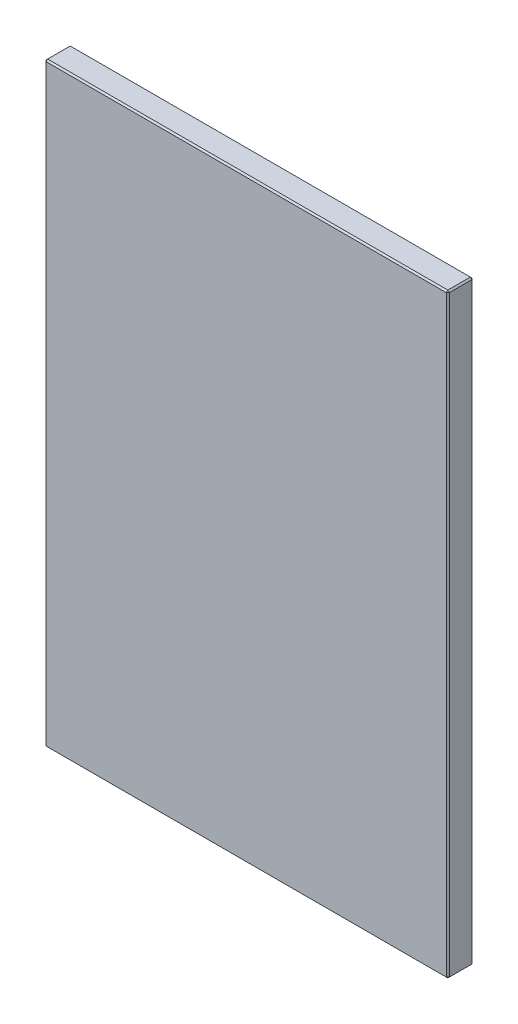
ISO-10303-21;
HEADER;
FILE_DESCRIPTION(('STEP AP214'),'2;1');
FILE_NAME('part.step','',(''),(''),'','','');
FILE_SCHEMA(('AUTOMOTIVE_DESIGN { 1 0 10303 214 1 1 1 1 }'));
ENDSEC;
DATA;
#1=APPLICATION_CONTEXT('core data for automotive mechanical design processes');
#2=APPLICATION_PROTOCOL_DEFINITION('international standard','automotive_design',2000,#1);
#3=PRODUCT_CONTEXT('',#1,'mechanical');
#4=PRODUCT('Part','Part','',(#3));
#5=PRODUCT_RELATED_PRODUCT_CATEGORY('part','',(#4));
#6=PRODUCT_DEFINITION_FORMATION('','',#4);
#7=PRODUCT_DEFINITION_CONTEXT('part definition',#1,'design');
#8=PRODUCT_DEFINITION('design','',#6,#7);
#9=PRODUCT_DEFINITION_SHAPE('','',#8);
#10=(LENGTH_UNIT() NAMED_UNIT(*) SI_UNIT(.MILLI.,.METRE.));
#11=(NAMED_UNIT(*) PLANE_ANGLE_UNIT() SI_UNIT($,.RADIAN.));
#12=(NAMED_UNIT(*) SI_UNIT($,.STERADIAN.) SOLID_ANGLE_UNIT());
#13=UNCERTAINTY_MEASURE_WITH_UNIT(LENGTH_MEASURE(1.E-05),#10,'distance_accuracy_value','');
#14=(GEOMETRIC_REPRESENTATION_CONTEXT(3) GLOBAL_UNCERTAINTY_ASSIGNED_CONTEXT((#13)) GLOBAL_UNIT_ASSIGNED_CONTEXT((#10,
#11,#12)) REPRESENTATION_CONTEXT('',''));
#15=CARTESIAN_POINT('',(0.,0.,0.));
#16=DIRECTION('',(0.,0.,1.));
#17=DIRECTION('',(1.,0.,0.));
#18=AXIS2_PLACEMENT_3D('',#15,#16,#17);
#19=CARTESIAN_POINT('',(-134.,-198.,17.));
#20=DIRECTION('',(1.,0.,0.));
#21=DIRECTION('',(0.,0.,-1.));
#22=AXIS2_PLACEMENT_3D('',#19,#20,#21);
#23=PLANE('',#22);
#24=DIRECTION('',(0.,0.,-1.));
#25=VECTOR('',#24,1.);
#26=CARTESIAN_POINT('',(-134.,197.,17.));
#27=LINE('',#26,#25);
#28=CARTESIAN_POINT('',(-134.,197.,16.));
#29=VERTEX_POINT('',#28);
#30=CARTESIAN_POINT('',(-134.,197.,1.));
#31=VERTEX_POINT('',#30);
#32=EDGE_CURVE('E114',#29,#31,#27,.T.);
#33=ORIENTED_EDGE('',*,*,#32,.T.);
#34=DIRECTION('',(0.,-1.,0.));
#35=VECTOR('',#34,1.);
#36=CARTESIAN_POINT('',(-134.,-198.,1.));
#37=LINE('',#36,#35);
#38=CARTESIAN_POINT('',(-134.,-197.,1.));
#39=VERTEX_POINT('',#38);
#40=EDGE_CURVE('E110',#31,#39,#37,.T.);
#41=ORIENTED_EDGE('',*,*,#40,.T.);
#42=DIRECTION('',(0.,0.,1.));
#43=VECTOR('',#42,1.);
#44=CARTESIAN_POINT('',(-134.,-197.,17.));
#45=LINE('',#44,#43);
#46=CARTESIAN_POINT('',(-134.,-197.,16.));
#47=VERTEX_POINT('',#46);
#48=EDGE_CURVE('E103',#39,#47,#45,.T.);
#49=ORIENTED_EDGE('',*,*,#48,.T.);
#50=DIRECTION('',(0.,1.,0.));
#51=VECTOR('',#50,1.);
#52=CARTESIAN_POINT('',(-134.,198.,16.));
#53=LINE('',#52,#51);
#54=EDGE_CURVE('E107',#47,#29,#53,.T.);
#55=ORIENTED_EDGE('',*,*,#54,.T.);
#56=EDGE_LOOP('',(#33,#41,#49,#55));
#57=FACE_BOUND('',#56,.T.);
#58=ADVANCED_FACE('F15',(#57),#23,.F.);
#59=CARTESIAN_POINT('',(134.,-198.,17.));
#60=DIRECTION('',(0.,1.,0.));
#61=DIRECTION('',(0.,0.,1.));
#62=AXIS2_PLACEMENT_3D('',#59,#60,#61);
#63=PLANE('',#62);
#64=DIRECTION('',(0.,0.,-1.));
#65=VECTOR('',#64,1.);
#66=CARTESIAN_POINT('',(-133.,-198.,17.));
#67=LINE('',#66,#65);
#68=CARTESIAN_POINT('',(-133.,-198.,16.));
#69=VERTEX_POINT('',#68);
#70=CARTESIAN_POINT('',(-133.,-198.,1.));
#71=VERTEX_POINT('',#70);
#72=EDGE_CURVE('E122',#69,#71,#67,.T.);
#73=ORIENTED_EDGE('',*,*,#72,.T.);
#74=DIRECTION('',(1.,0.,0.));
#75=VECTOR('',#74,1.);
#76=CARTESIAN_POINT('',(134.,-198.,1.));
#77=LINE('',#76,#75);
#78=CARTESIAN_POINT('',(133.,-198.,1.));
#79=VERTEX_POINT('',#78);
#80=EDGE_CURVE('E160',#71,#79,#77,.T.);
#81=ORIENTED_EDGE('',*,*,#80,.T.);
#82=DIRECTION('',(0.,0.,1.));
#83=VECTOR('',#82,1.);
#84=CARTESIAN_POINT('',(133.,-198.,17.));
#85=LINE('',#84,#83);
#86=CARTESIAN_POINT('',(133.,-198.,16.));
#87=VERTEX_POINT('',#86);
#88=EDGE_CURVE('E157',#79,#87,#85,.T.);
#89=ORIENTED_EDGE('',*,*,#88,.T.);
#90=DIRECTION('',(-1.,0.,0.));
#91=VECTOR('',#90,1.);
#92=CARTESIAN_POINT('',(-134.,-198.,16.));
#93=LINE('',#92,#91);
#94=EDGE_CURVE('E155',#87,#69,#93,.T.);
#95=ORIENTED_EDGE('',*,*,#94,.T.);
#96=EDGE_LOOP('',(#73,#81,#89,#95));
#97=FACE_BOUND('',#96,.T.);
#98=ADVANCED_FACE('F277',(#97),#63,.F.);
#99=CARTESIAN_POINT('',(134.,-198.,17.));
#100=DIRECTION('',(-1.,0.,0.));
#101=DIRECTION('',(0.,0.,1.));
#102=AXIS2_PLACEMENT_3D('',#99,#100,#101);
#103=PLANE('',#102);
#104=DIRECTION('',(0.,-1.,0.));
#105=VECTOR('',#104,1.);
#106=CARTESIAN_POINT('',(134.,-198.,16.));
#107=LINE('',#106,#105);
#108=CARTESIAN_POINT('',(134.,197.,16.));
#109=VERTEX_POINT('',#108);
#110=CARTESIAN_POINT('',(134.,-197.,16.));
#111=VERTEX_POINT('',#110);
#112=EDGE_CURVE('E162',#109,#111,#107,.T.);
#113=ORIENTED_EDGE('',*,*,#112,.T.);
#114=DIRECTION('',(0.,0.,-1.));
#115=VECTOR('',#114,1.);
#116=CARTESIAN_POINT('',(134.,-197.,17.));
#117=LINE('',#116,#115);
#118=CARTESIAN_POINT('',(134.,-197.,1.));
#119=VERTEX_POINT('',#118);
#120=EDGE_CURVE('E168',#111,#119,#117,.T.);
#121=ORIENTED_EDGE('',*,*,#120,.T.);
#122=DIRECTION('',(0.,1.,0.));
#123=VECTOR('',#122,1.);
#124=CARTESIAN_POINT('',(134.,-198.,1.));
#125=LINE('',#124,#123);
#126=CARTESIAN_POINT('',(134.,197.,1.));
#127=VERTEX_POINT('',#126);
#128=EDGE_CURVE('E166',#119,#127,#125,.T.);
#129=ORIENTED_EDGE('',*,*,#128,.T.);
#130=DIRECTION('',(0.,0.,1.));
#131=VECTOR('',#130,1.);
#132=CARTESIAN_POINT('',(134.,197.,17.));
#133=LINE('',#132,#131);
#134=EDGE_CURVE('E164',#127,#109,#133,.T.);
#135=ORIENTED_EDGE('',*,*,#134,.T.);
#136=EDGE_LOOP('',(#113,#121,#129,#135));
#137=FACE_BOUND('',#136,.T.);
#138=ADVANCED_FACE('F254',(#137),#103,.F.);
#139=CARTESIAN_POINT('',(134.,198.,17.));
#140=DIRECTION('',(0.,-1.,0.));
#141=DIRECTION('',(1.,0.,0.));
#142=AXIS2_PLACEMENT_3D('',#139,#140,#141);
#143=PLANE('',#142);
#144=DIRECTION('',(-1.,0.,0.));
#145=VECTOR('',#144,1.);
#146=CARTESIAN_POINT('',(134.,198.,1.));
#147=LINE('',#146,#145);
#148=CARTESIAN_POINT('',(133.,198.,1.));
#149=VERTEX_POINT('',#148);
#150=CARTESIAN_POINT('',(-133.,198.,1.));
#151=VERTEX_POINT('',#150);
#152=EDGE_CURVE('E150',#149,#151,#147,.T.);
#153=ORIENTED_EDGE('',*,*,#152,.T.);
#154=DIRECTION('',(0.,0.,1.));
#155=VECTOR('',#154,1.);
#156=CARTESIAN_POINT('',(-133.,198.,17.));
#157=LINE('',#156,#155);
#158=CARTESIAN_POINT('',(-133.,198.,16.));
#159=VERTEX_POINT('',#158);
#160=EDGE_CURVE('E152',#151,#159,#157,.T.);
#161=ORIENTED_EDGE('',*,*,#160,.T.);
#162=DIRECTION('',(1.,0.,0.));
#163=VECTOR('',#162,1.);
#164=CARTESIAN_POINT('',(134.,198.,16.));
#165=LINE('',#164,#163);
#166=CARTESIAN_POINT('',(133.,198.,16.));
#167=VERTEX_POINT('',#166);
#168=EDGE_CURVE('E146',#159,#167,#165,.T.);
#169=ORIENTED_EDGE('',*,*,#168,.T.);
#170=DIRECTION('',(0.,0.,-1.));
#171=VECTOR('',#170,1.);
#172=CARTESIAN_POINT('',(133.,198.,17.));
#173=LINE('',#172,#171);
#174=EDGE_CURVE('E148',#167,#149,#173,.T.);
#175=ORIENTED_EDGE('',*,*,#174,.T.);
#176=EDGE_LOOP('',(#153,#161,#169,#175));
#177=FACE_BOUND('',#176,.T.);
#178=ADVANCED_FACE('F286',(#177),#143,.F.);
#179=CARTESIAN_POINT('',(0.,0.,17.));
#180=DIRECTION('',(0.,0.,1.));
#181=DIRECTION('',(1.,0.,0.));
#182=AXIS2_PLACEMENT_3D('',#179,#180,#181);
#183=PLANE('',#182);
#184=DIRECTION('',(0.,1.,0.));
#185=VECTOR('',#184,1.);
#186=CARTESIAN_POINT('',(133.,198.,17.));
#187=LINE('',#186,#185);
#188=CARTESIAN_POINT('',(133.,-197.,17.));
#189=VERTEX_POINT('',#188);
#190=CARTESIAN_POINT('',(133.,197.,17.));
#191=VERTEX_POINT('',#190);
#192=EDGE_CURVE('E24',#189,#191,#187,.T.);
#193=ORIENTED_EDGE('',*,*,#192,.T.);
#194=DIRECTION('',(-1.,0.,0.));
#195=VECTOR('',#194,1.);
#196=CARTESIAN_POINT('',(-134.,197.,17.));
#197=LINE('',#196,#195);
#198=CARTESIAN_POINT('',(-133.,197.,17.));
#199=VERTEX_POINT('',#198);
#200=EDGE_CURVE('E9',#191,#199,#197,.T.);
#201=ORIENTED_EDGE('',*,*,#200,.T.);
#202=DIRECTION('',(0.,-1.,0.));
#203=VECTOR('',#202,1.);
#204=CARTESIAN_POINT('',(-133.,-198.,17.));
#205=LINE('',#204,#203);
#206=CARTESIAN_POINT('',(-133.,-197.,17.));
#207=VERTEX_POINT('',#206);
#208=EDGE_CURVE('E180',#199,#207,#205,.T.);
#209=ORIENTED_EDGE('',*,*,#208,.T.);
#210=DIRECTION('',(1.,0.,0.));
#211=VECTOR('',#210,1.);
#212=CARTESIAN_POINT('',(134.,-197.,17.));
#213=LINE('',#212,#211);
#214=EDGE_CURVE('E35',#207,#189,#213,.T.);
#215=ORIENTED_EDGE('',*,*,#214,.T.);
#216=EDGE_LOOP('',(#193,#201,#209,#215));
#217=FACE_BOUND('',#216,.T.);
#218=ADVANCED_FACE('F351',(#217),#183,.T.);
#219=CARTESIAN_POINT('',(0.,0.,0.));
#220=DIRECTION('',(0.,0.,1.));
#221=DIRECTION('',(1.,0.,0.));
#222=AXIS2_PLACEMENT_3D('',#219,#220,#221);
#223=PLANE('',#222);
#224=DIRECTION('',(0.,-1.,0.));
#225=VECTOR('',#224,1.);
#226=CARTESIAN_POINT('',(133.,0.,0.));
#227=LINE('',#226,#225);
#228=CARTESIAN_POINT('',(133.,197.,0.));
#229=VERTEX_POINT('',#228);
#230=CARTESIAN_POINT('',(133.,-197.,0.));
#231=VERTEX_POINT('',#230);
#232=EDGE_CURVE('E175',#229,#231,#227,.T.);
#233=ORIENTED_EDGE('',*,*,#232,.T.);
#234=DIRECTION('',(-1.,0.,0.));
#235=VECTOR('',#234,1.);
#236=CARTESIAN_POINT('',(0.,-197.,0.));
#237=LINE('',#236,#235);
#238=CARTESIAN_POINT('',(-133.,-197.,0.));
#239=VERTEX_POINT('',#238);
#240=EDGE_CURVE('E177',#231,#239,#237,.T.);
#241=ORIENTED_EDGE('',*,*,#240,.T.);
#242=DIRECTION('',(0.,1.,0.));
#243=VECTOR('',#242,1.);
#244=CARTESIAN_POINT('',(-133.,0.,0.));
#245=LINE('',#244,#243);
#246=CARTESIAN_POINT('',(-133.,197.,0.));
#247=VERTEX_POINT('',#246);
#248=EDGE_CURVE('E173',#239,#247,#245,.T.);
#249=ORIENTED_EDGE('',*,*,#248,.T.);
#250=DIRECTION('',(1.,0.,0.));
#251=VECTOR('',#250,1.);
#252=CARTESIAN_POINT('',(0.,197.,0.));
#253=LINE('',#252,#251);
#254=EDGE_CURVE('E171',#247,#229,#253,.T.);
#255=ORIENTED_EDGE('',*,*,#254,.T.);
#256=EDGE_LOOP('',(#233,#241,#249,#255));
#257=FACE_BOUND('',#256,.T.);
#258=ADVANCED_FACE('F246',(#257),#223,.F.);
#259=CARTESIAN_POINT('',(134.,-197.,17.));
#260=DIRECTION('',(-0.707106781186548,0.707106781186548,0.));
#261=DIRECTION('',(0.,0.,-1.));
#262=AXIS2_PLACEMENT_3D('',#259,#260,#261);
#263=PLANE('',#262);
#264=DIRECTION('',(-0.707106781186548,-0.707106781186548,0.));
#265=VECTOR('',#264,1.);
#266=CARTESIAN_POINT('',(133.,-198.,16.));
#267=LINE('',#266,#265);
#268=EDGE_CURVE('E19',#87,#111,#267,.F.);
#269=ORIENTED_EDGE('',*,*,#268,.F.);
#270=ORIENTED_EDGE('',*,*,#88,.F.);
#271=DIRECTION('',(0.707106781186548,0.707106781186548,0.));
#272=VECTOR('',#271,1.);
#273=CARTESIAN_POINT('',(134.,-197.,1.));
#274=LINE('',#273,#272);
#275=EDGE_CURVE('E142',#119,#79,#274,.F.);
#276=ORIENTED_EDGE('',*,*,#275,.F.);
#277=ORIENTED_EDGE('',*,*,#120,.F.);
#278=EDGE_LOOP('',(#269,#270,#276,#277));
#279=FACE_BOUND('',#278,.T.);
#280=ADVANCED_FACE('F17',(#279),#263,.F.);
#281=CARTESIAN_POINT('',(133.,-198.,16.));
#282=DIRECTION('',(0.577350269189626,-0.577350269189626,0.577350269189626));
#283=DIRECTION('',(0.707106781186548,0.,-0.707106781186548));
#284=AXIS2_PLACEMENT_3D('',#281,#282,#283);
#285=PLANE('',#284);
#286=DIRECTION('',(0.,-0.707106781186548,-0.707106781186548));
#287=VECTOR('',#286,1.);
#288=CARTESIAN_POINT('',(133.,-198.,16.));
#289=LINE('',#288,#287);
#290=EDGE_CURVE('E227',#87,#189,#289,.F.);
#291=ORIENTED_EDGE('',*,*,#290,.F.);
#292=ORIENTED_EDGE('',*,*,#268,.T.);
#293=DIRECTION('',(-0.707106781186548,0.,0.707106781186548));
#294=VECTOR('',#293,1.);
#295=CARTESIAN_POINT('',(133.5,-197.,16.5));
#296=LINE('',#295,#294);
#297=EDGE_CURVE('E229',#189,#111,#296,.F.);
#298=ORIENTED_EDGE('',*,*,#297,.F.);
#299=EDGE_LOOP('',(#291,#292,#298));
#300=FACE_BOUND('',#299,.T.);
#301=ADVANCED_FACE('F272',(#300),#285,.T.);
#302=CARTESIAN_POINT('',(134.,-197.,1.));
#303=DIRECTION('',(0.577350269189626,-0.577350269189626,-0.577350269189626));
#304=DIRECTION('',(-0.707106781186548,0.,-0.707106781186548));
#305=AXIS2_PLACEMENT_3D('',#302,#303,#304);
#306=PLANE('',#305);
#307=DIRECTION('',(-0.707106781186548,0.,-0.707106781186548));
#308=VECTOR('',#307,1.);
#309=CARTESIAN_POINT('',(134.,-197.,1.));
#310=LINE('',#309,#308);
#311=EDGE_CURVE('E221',#119,#231,#310,.T.);
#312=ORIENTED_EDGE('',*,*,#311,.F.);
#313=ORIENTED_EDGE('',*,*,#275,.T.);
#314=DIRECTION('',(0.,-0.707106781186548,0.707106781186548));
#315=VECTOR('',#314,1.);
#316=CARTESIAN_POINT('',(133.,-197.5,0.5));
#317=LINE('',#316,#315);
#318=EDGE_CURVE('E224',#231,#79,#317,.T.);
#319=ORIENTED_EDGE('',*,*,#318,.F.);
#320=EDGE_LOOP('',(#312,#313,#319));
#321=FACE_BOUND('',#320,.T.);
#322=ADVANCED_FACE('F236',(#321),#306,.T.);
#323=CARTESIAN_POINT('',(133.,0.,17.));
#324=DIRECTION('',(0.707106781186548,0.,0.707106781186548));
#325=DIRECTION('',(0.,-1.,0.));
#326=AXIS2_PLACEMENT_3D('',#323,#324,#325);
#327=PLANE('',#326);
#328=ORIENTED_EDGE('',*,*,#297,.T.);
#329=ORIENTED_EDGE('',*,*,#112,.F.);
#330=DIRECTION('',(0.707106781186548,0.,-0.707106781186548));
#331=VECTOR('',#330,1.);
#332=CARTESIAN_POINT('',(134.,197.,16.));
#333=LINE('',#332,#331);
#334=EDGE_CURVE('E215',#191,#109,#333,.T.);
#335=ORIENTED_EDGE('',*,*,#334,.F.);
#336=ORIENTED_EDGE('',*,*,#192,.F.);
#337=EDGE_LOOP('',(#328,#329,#335,#336));
#338=FACE_BOUND('',#337,.T.);
#339=ADVANCED_FACE('F267',(#338),#327,.T.);
#340=CARTESIAN_POINT('',(0.,-197.,17.));
#341=DIRECTION('',(0.,-0.707106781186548,0.707106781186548));
#342=DIRECTION('',(-1.,0.,0.));
#343=AXIS2_PLACEMENT_3D('',#340,#341,#342);
#344=PLANE('',#343);
#345=ORIENTED_EDGE('',*,*,#290,.T.);
#346=ORIENTED_EDGE('',*,*,#214,.F.);
#347=DIRECTION('',(0.,0.707106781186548,0.707106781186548));
#348=VECTOR('',#347,1.);
#349=CARTESIAN_POINT('',(-133.,-197.5,16.5));
#350=LINE('',#349,#348);
#351=EDGE_CURVE('E126',#69,#207,#350,.T.);
#352=ORIENTED_EDGE('',*,*,#351,.F.);
#353=ORIENTED_EDGE('',*,*,#94,.F.);
#354=EDGE_LOOP('',(#345,#346,#352,#353));
#355=FACE_BOUND('',#354,.T.);
#356=ADVANCED_FACE('F275',(#355),#344,.T.);
#357=CARTESIAN_POINT('',(-133.,-198.,17.));
#358=DIRECTION('',(0.707106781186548,0.707106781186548,0.));
#359=DIRECTION('',(0.,0.,-1.));
#360=AXIS2_PLACEMENT_3D('',#357,#358,#359);
#361=PLANE('',#360);
#362=DIRECTION('',(0.707106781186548,-0.707106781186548,0.));
#363=VECTOR('',#362,1.);
#364=CARTESIAN_POINT('',(-133.,-198.,1.));
#365=LINE('',#364,#363);
#366=EDGE_CURVE('E127',#71,#39,#365,.F.);
#367=ORIENTED_EDGE('',*,*,#366,.F.);
#368=ORIENTED_EDGE('',*,*,#72,.F.);
#369=DIRECTION('',(-0.707106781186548,0.707106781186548,0.));
#370=VECTOR('',#369,1.);
#371=CARTESIAN_POINT('',(-134.,-197.,16.));
#372=LINE('',#371,#370);
#373=EDGE_CURVE('E118',#47,#69,#372,.F.);
#374=ORIENTED_EDGE('',*,*,#373,.F.);
#375=ORIENTED_EDGE('',*,*,#48,.F.);
#376=EDGE_LOOP('',(#367,#368,#374,#375));
#377=FACE_BOUND('',#376,.T.);
#378=ADVANCED_FACE('F120',(#377),#361,.F.);
#379=CARTESIAN_POINT('',(134.,-198.,1.));
#380=DIRECTION('',(0.,0.707106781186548,0.707106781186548));
#381=DIRECTION('',(1.,0.,0.));
#382=AXIS2_PLACEMENT_3D('',#379,#380,#381);
#383=PLANE('',#382);
#384=ORIENTED_EDGE('',*,*,#318,.T.);
#385=ORIENTED_EDGE('',*,*,#80,.F.);
#386=DIRECTION('',(0.,0.707106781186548,-0.707106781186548));
#387=VECTOR('',#386,1.);
#388=CARTESIAN_POINT('',(-133.,-198.,1.));
#389=LINE('',#388,#387);
#390=EDGE_CURVE('E211',#239,#71,#389,.F.);
#391=ORIENTED_EDGE('',*,*,#390,.F.);
#392=ORIENTED_EDGE('',*,*,#240,.F.);
#393=EDGE_LOOP('',(#384,#385,#391,#392));
#394=FACE_BOUND('',#393,.T.);
#395=ADVANCED_FACE('F243',(#394),#383,.F.);
#396=CARTESIAN_POINT('',(134.,-198.,1.));
#397=DIRECTION('',(-0.707106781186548,0.,0.707106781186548));
#398=DIRECTION('',(0.,1.,0.));
#399=AXIS2_PLACEMENT_3D('',#396,#397,#398);
#400=PLANE('',#399);
#401=ORIENTED_EDGE('',*,*,#311,.T.);
#402=ORIENTED_EDGE('',*,*,#232,.F.);
#403=DIRECTION('',(0.707106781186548,0.,0.707106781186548));
#404=VECTOR('',#403,1.);
#405=CARTESIAN_POINT('',(134.,197.,1.));
#406=LINE('',#405,#404);
#407=EDGE_CURVE('E208',#127,#229,#406,.F.);
#408=ORIENTED_EDGE('',*,*,#407,.F.);
#409=ORIENTED_EDGE('',*,*,#128,.F.);
#410=EDGE_LOOP('',(#401,#402,#408,#409));
#411=FACE_BOUND('',#410,.T.);
#412=ADVANCED_FACE('F251',(#411),#400,.F.);
#413=CARTESIAN_POINT('',(133.,198.,17.));
#414=DIRECTION('',(-0.707106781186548,-0.707106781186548,0.));
#415=DIRECTION('',(0.,0.,-1.));
#416=AXIS2_PLACEMENT_3D('',#413,#414,#415);
#417=PLANE('',#416);
#418=DIRECTION('',(0.707106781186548,-0.707106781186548,0.));
#419=VECTOR('',#418,1.);
#420=CARTESIAN_POINT('',(134.,197.,16.));
#421=LINE('',#420,#419);
#422=EDGE_CURVE('E218',#109,#167,#421,.F.);
#423=ORIENTED_EDGE('',*,*,#422,.F.);
#424=ORIENTED_EDGE('',*,*,#134,.F.);
#425=DIRECTION('',(-0.707106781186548,0.707106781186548,0.));
#426=VECTOR('',#425,1.);
#427=CARTESIAN_POINT('',(134.,197.,1.));
#428=LINE('',#427,#426);
#429=EDGE_CURVE('E205',#149,#127,#428,.F.);
#430=ORIENTED_EDGE('',*,*,#429,.F.);
#431=ORIENTED_EDGE('',*,*,#174,.F.);
#432=EDGE_LOOP('',(#423,#424,#430,#431));
#433=FACE_BOUND('',#432,.T.);
#434=ADVANCED_FACE('F259',(#433),#417,.F.);
#435=CARTESIAN_POINT('',(134.,197.,16.));
#436=DIRECTION('',(0.577350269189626,0.577350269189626,0.577350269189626));
#437=DIRECTION('',(0.707106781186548,0.,-0.707106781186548));
#438=AXIS2_PLACEMENT_3D('',#435,#436,#437);
#439=PLANE('',#438);
#440=ORIENTED_EDGE('',*,*,#334,.T.);
#441=ORIENTED_EDGE('',*,*,#422,.T.);
#442=DIRECTION('',(0.,-0.707106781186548,0.707106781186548));
#443=VECTOR('',#442,1.);
#444=CARTESIAN_POINT('',(133.,197.5,16.5));
#445=LINE('',#444,#443);
#446=EDGE_CURVE('E134',#191,#167,#445,.F.);
#447=ORIENTED_EDGE('',*,*,#446,.F.);
#448=EDGE_LOOP('',(#440,#441,#447));
#449=FACE_BOUND('',#448,.T.);
#450=ADVANCED_FACE('F264',(#449),#439,.T.);
#451=CARTESIAN_POINT('',(-134.,-197.,16.));
#452=DIRECTION('',(-0.577350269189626,-0.577350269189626,0.577350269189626));
#453=DIRECTION('',(0.707106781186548,0.,0.707106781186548));
#454=AXIS2_PLACEMENT_3D('',#451,#452,#453);
#455=PLANE('',#454);
#456=ORIENTED_EDGE('',*,*,#373,.T.);
#457=ORIENTED_EDGE('',*,*,#351,.T.);
#458=DIRECTION('',(-0.707106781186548,0.,-0.707106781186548));
#459=VECTOR('',#458,1.);
#460=CARTESIAN_POINT('',(-134.,-197.,16.));
#461=LINE('',#460,#459);
#462=EDGE_CURVE('E130',#47,#207,#461,.F.);
#463=ORIENTED_EDGE('',*,*,#462,.F.);
#464=EDGE_LOOP('',(#456,#457,#463));
#465=FACE_BOUND('',#464,.T.);
#466=ADVANCED_FACE('F131',(#465),#455,.T.);
#467=CARTESIAN_POINT('',(-133.,-198.,1.));
#468=DIRECTION('',(-0.577350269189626,-0.577350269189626,-0.577350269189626));
#469=DIRECTION('',(-0.707106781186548,0.,0.707106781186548));
#470=AXIS2_PLACEMENT_3D('',#467,#468,#469);
#471=PLANE('',#470);
#472=ORIENTED_EDGE('',*,*,#390,.T.);
#473=ORIENTED_EDGE('',*,*,#366,.T.);
#474=DIRECTION('',(-0.707106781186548,0.,0.707106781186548));
#475=VECTOR('',#474,1.);
#476=CARTESIAN_POINT('',(-133.5,-197.,0.5));
#477=LINE('',#476,#475);
#478=EDGE_CURVE('E135',#239,#39,#477,.T.);
#479=ORIENTED_EDGE('',*,*,#478,.F.);
#480=EDGE_LOOP('',(#472,#473,#479));
#481=FACE_BOUND('',#480,.T.);
#482=ADVANCED_FACE('F320',(#481),#471,.T.);
#483=CARTESIAN_POINT('',(134.,197.,1.));
#484=DIRECTION('',(0.577350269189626,0.577350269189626,-0.577350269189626));
#485=DIRECTION('',(-0.707106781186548,0.,-0.707106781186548));
#486=AXIS2_PLACEMENT_3D('',#483,#484,#485);
#487=PLANE('',#486);
#488=ORIENTED_EDGE('',*,*,#429,.T.);
#489=ORIENTED_EDGE('',*,*,#407,.T.);
#490=DIRECTION('',(0.,-0.707106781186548,-0.707106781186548));
#491=VECTOR('',#490,1.);
#492=CARTESIAN_POINT('',(133.,197.5,0.5));
#493=LINE('',#492,#491);
#494=EDGE_CURVE('E198',#149,#229,#493,.T.);
#495=ORIENTED_EDGE('',*,*,#494,.F.);
#496=EDGE_LOOP('',(#488,#489,#495));
#497=FACE_BOUND('',#496,.T.);
#498=ADVANCED_FACE('F316',(#497),#487,.T.);
#499=CARTESIAN_POINT('',(0.,197.,17.));
#500=DIRECTION('',(0.,0.707106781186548,0.707106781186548));
#501=DIRECTION('',(1.,0.,0.));
#502=AXIS2_PLACEMENT_3D('',#499,#500,#501);
#503=PLANE('',#502);
#504=ORIENTED_EDGE('',*,*,#446,.T.);
#505=ORIENTED_EDGE('',*,*,#168,.F.);
#506=DIRECTION('',(0.,0.707106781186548,-0.707106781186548));
#507=VECTOR('',#506,1.);
#508=CARTESIAN_POINT('',(-133.,198.,16.));
#509=LINE('',#508,#507);
#510=EDGE_CURVE('E195',#199,#159,#509,.T.);
#511=ORIENTED_EDGE('',*,*,#510,.F.);
#512=ORIENTED_EDGE('',*,*,#200,.F.);
#513=EDGE_LOOP('',(#504,#505,#511,#512));
#514=FACE_BOUND('',#513,.T.);
#515=ADVANCED_FACE('F313',(#514),#503,.T.);
#516=CARTESIAN_POINT('',(-133.,0.,17.));
#517=DIRECTION('',(-0.707106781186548,0.,0.707106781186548));
#518=DIRECTION('',(0.,1.,0.));
#519=AXIS2_PLACEMENT_3D('',#516,#517,#518);
#520=PLANE('',#519);
#521=ORIENTED_EDGE('',*,*,#462,.T.);
#522=ORIENTED_EDGE('',*,*,#208,.F.);
#523=DIRECTION('',(0.707106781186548,0.,0.707106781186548));
#524=VECTOR('',#523,1.);
#525=CARTESIAN_POINT('',(-133.5,197.,16.5));
#526=LINE('',#525,#524);
#527=EDGE_CURVE('E138',#29,#199,#526,.T.);
#528=ORIENTED_EDGE('',*,*,#527,.F.);
#529=ORIENTED_EDGE('',*,*,#54,.F.);
#530=EDGE_LOOP('',(#521,#522,#528,#529));
#531=FACE_BOUND('',#530,.T.);
#532=ADVANCED_FACE('F137',(#531),#520,.T.);
#533=CARTESIAN_POINT('',(-134.,-198.,1.));
#534=DIRECTION('',(0.707106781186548,0.,0.707106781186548));
#535=DIRECTION('',(0.,-1.,0.));
#536=AXIS2_PLACEMENT_3D('',#533,#534,#535);
#537=PLANE('',#536);
#538=ORIENTED_EDGE('',*,*,#478,.T.);
#539=ORIENTED_EDGE('',*,*,#40,.F.);
#540=DIRECTION('',(0.707106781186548,0.,-0.707106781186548));
#541=VECTOR('',#540,1.);
#542=CARTESIAN_POINT('',(-134.,197.,1.));
#543=LINE('',#542,#541);
#544=EDGE_CURVE('E191',#247,#31,#543,.F.);
#545=ORIENTED_EDGE('',*,*,#544,.F.);
#546=ORIENTED_EDGE('',*,*,#248,.F.);
#547=EDGE_LOOP('',(#538,#539,#545,#546));
#548=FACE_BOUND('',#547,.T.);
#549=ADVANCED_FACE('F306',(#548),#537,.F.);
#550=CARTESIAN_POINT('',(134.,198.,1.));
#551=DIRECTION('',(0.,-0.707106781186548,0.707106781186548));
#552=DIRECTION('',(-1.,0.,0.));
#553=AXIS2_PLACEMENT_3D('',#550,#551,#552);
#554=PLANE('',#553);
#555=ORIENTED_EDGE('',*,*,#494,.T.);
#556=ORIENTED_EDGE('',*,*,#254,.F.);
#557=DIRECTION('',(0.,0.707106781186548,0.707106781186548));
#558=VECTOR('',#557,1.);
#559=CARTESIAN_POINT('',(-133.,197.5,0.5));
#560=LINE('',#559,#558);
#561=EDGE_CURVE('E188',#151,#247,#560,.F.);
#562=ORIENTED_EDGE('',*,*,#561,.F.);
#563=ORIENTED_EDGE('',*,*,#152,.F.);
#564=EDGE_LOOP('',(#555,#556,#562,#563));
#565=FACE_BOUND('',#564,.T.);
#566=ADVANCED_FACE('F302',(#565),#554,.F.);
#567=CARTESIAN_POINT('',(-133.,198.,16.));
#568=DIRECTION('',(-0.577350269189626,0.577350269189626,0.577350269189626));
#569=DIRECTION('',(0.707106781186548,0.,0.707106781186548));
#570=AXIS2_PLACEMENT_3D('',#567,#568,#569);
#571=PLANE('',#570);
#572=ORIENTED_EDGE('',*,*,#527,.T.);
#573=ORIENTED_EDGE('',*,*,#510,.T.);
#574=DIRECTION('',(0.707106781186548,0.707106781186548,0.));
#575=VECTOR('',#574,1.);
#576=CARTESIAN_POINT('',(-133.,198.,16.));
#577=LINE('',#576,#575);
#578=EDGE_CURVE('E186',#29,#159,#577,.T.);
#579=ORIENTED_EDGE('',*,*,#578,.F.);
#580=EDGE_LOOP('',(#572,#573,#579));
#581=FACE_BOUND('',#580,.T.);
#582=ADVANCED_FACE('F298',(#581),#571,.T.);
#583=CARTESIAN_POINT('',(-134.,197.,1.));
#584=DIRECTION('',(-0.577350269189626,0.577350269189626,-0.577350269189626));
#585=DIRECTION('',(-0.707106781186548,0.,0.707106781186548));
#586=AXIS2_PLACEMENT_3D('',#583,#584,#585);
#587=PLANE('',#586);
#588=ORIENTED_EDGE('',*,*,#561,.T.);
#589=ORIENTED_EDGE('',*,*,#544,.T.);
#590=DIRECTION('',(-0.707106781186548,-0.707106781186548,0.));
#591=VECTOR('',#590,1.);
#592=CARTESIAN_POINT('',(-134.,197.,1.));
#593=LINE('',#592,#591);
#594=EDGE_CURVE('E184',#151,#31,#593,.T.);
#595=ORIENTED_EDGE('',*,*,#594,.F.);
#596=EDGE_LOOP('',(#588,#589,#595));
#597=FACE_BOUND('',#596,.T.);
#598=ADVANCED_FACE('F294',(#597),#587,.T.);
#599=CARTESIAN_POINT('',(-134.,197.,17.));
#600=DIRECTION('',(0.707106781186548,-0.707106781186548,0.));
#601=DIRECTION('',(0.,0.,-1.));
#602=AXIS2_PLACEMENT_3D('',#599,#600,#601);
#603=PLANE('',#602);
#604=ORIENTED_EDGE('',*,*,#578,.T.);
#605=ORIENTED_EDGE('',*,*,#160,.F.);
#606=ORIENTED_EDGE('',*,*,#594,.T.);
#607=ORIENTED_EDGE('',*,*,#32,.F.);
#608=EDGE_LOOP('',(#604,#605,#606,#607));
#609=FACE_BOUND('',#608,.T.);
#610=ADVANCED_FACE('F291',(#609),#603,.F.);
#611=CLOSED_SHELL('',(#58,#98,#138,#178,#218,#258,#280,#301,#322,#339,#356,#378,#395,#412,#434,
#450,#466,#482,#498,#515,#532,#549,#566,#582,#598,#610));
#612=MANIFOLD_SOLID_BREP('B1',#611);
#613=ADVANCED_BREP_SHAPE_REPRESENTATION('',(#18,#612),#14);
#614=SHAPE_DEFINITION_REPRESENTATION(#9,#613);
ENDSEC;
END-ISO-10303-21;
